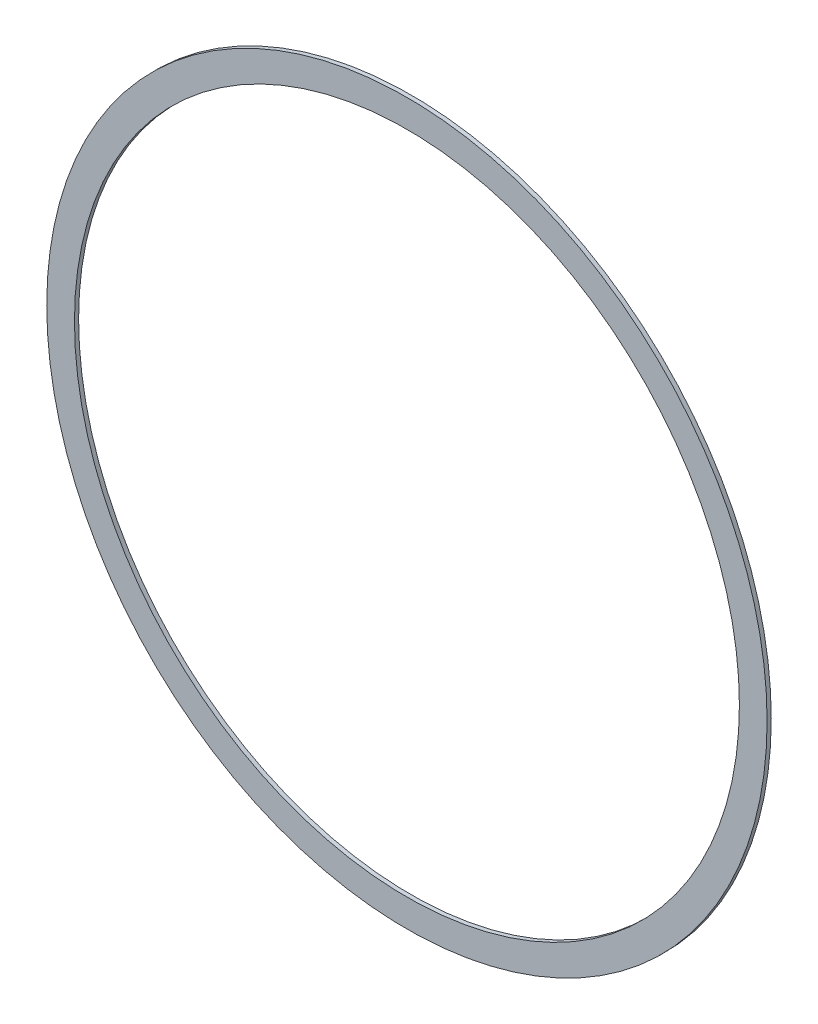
from build123d import *

# Parameters (mm, degrees)
SKETCH1_R           = 1651
SKETCH1_R_2         = 1524
BOSS_EXTRUDE1_DEPTH = 19.05


with BuildPart() as part:
    # Sketch1 → Boss-Extrude1 (new body)
    with BuildSketch(Plane.XY):
        with Locations(Location((0, 0, 0), (0, 0, 180))):
            Circle(SKETCH1_R)
        with Locations(Location((0, 0, 0), (0, 0, 180))):
            Circle(SKETCH1_R_2, mode=Mode.SUBTRACT)
    extrude(amount=BOSS_EXTRUDE1_DEPTH)


solid = part.part
